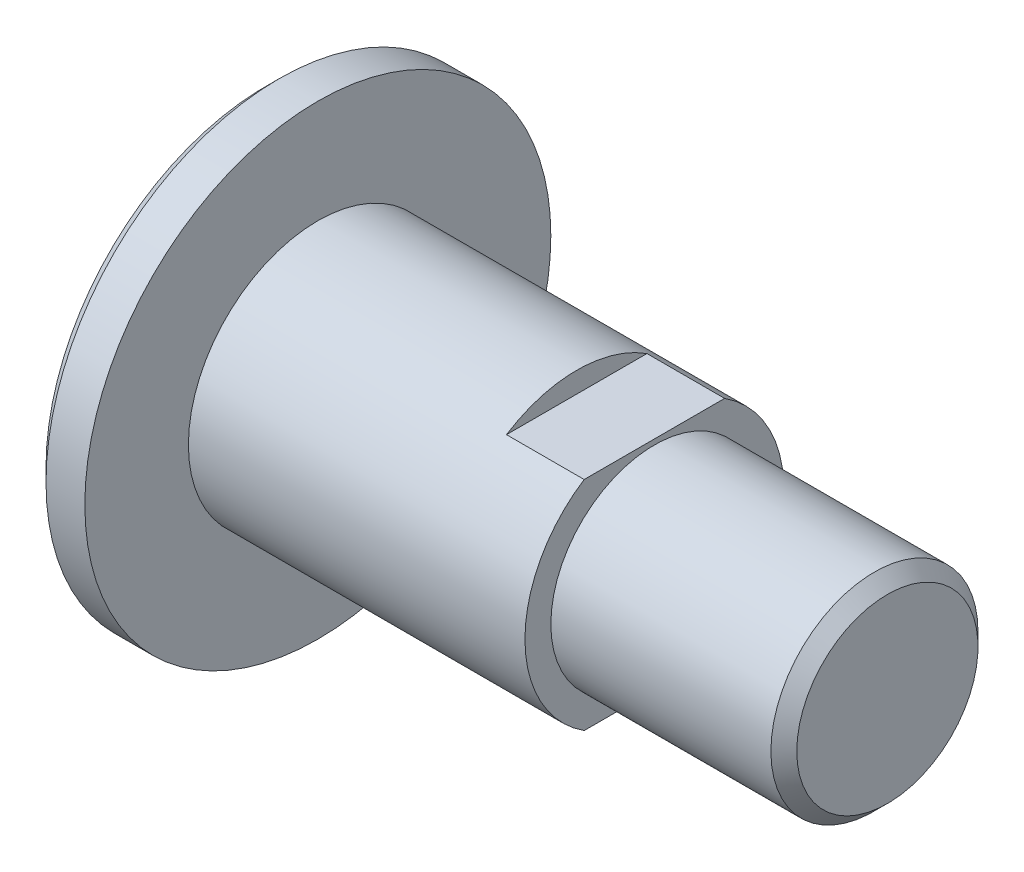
from build123d import *

# Parameters (mm, degrees)
ESQUISSE2_W             = 4
ESQUISSE2_H             = 1.3
ENL_V_MAT_EXTRU_1_DEPTH = 11


with BuildPart() as part:
    # Esquisse1 → Base-R_volution (revolve)
    with BuildSketch(Plane.XY, mode=Mode.PRIVATE) as base_r_volution_sk:
        Polygon((0, 0), (0, 8.5), (0.5, 9), (2, 9), (2, 5), (15, 5), (15, 4), (23.5, 4), (24, 3.5), (24, 0), align=None)
    revolve(base_r_volution_sk.sketch.rotate(Axis((-3, 0, 0), (1, 0, 0)), 90), axis=Axis((-3, 0, 0), (1, 0, 0)))

    # Esquisse2 → Enl_v. mat.-Extru.1 (cut, symmetric)
    with BuildSketch(Plane.XY):
        with Locations((14, 4.85)):
            Rectangle(ESQUISSE2_W, ESQUISSE2_H)
        with Locations((14, -4.85)):
            Rectangle(ESQUISSE2_W, ESQUISSE2_H)
    extrude(amount=ENL_V_MAT_EXTRU_1_DEPTH, both=True, mode=Mode.SUBTRACT)


solid = part.part
